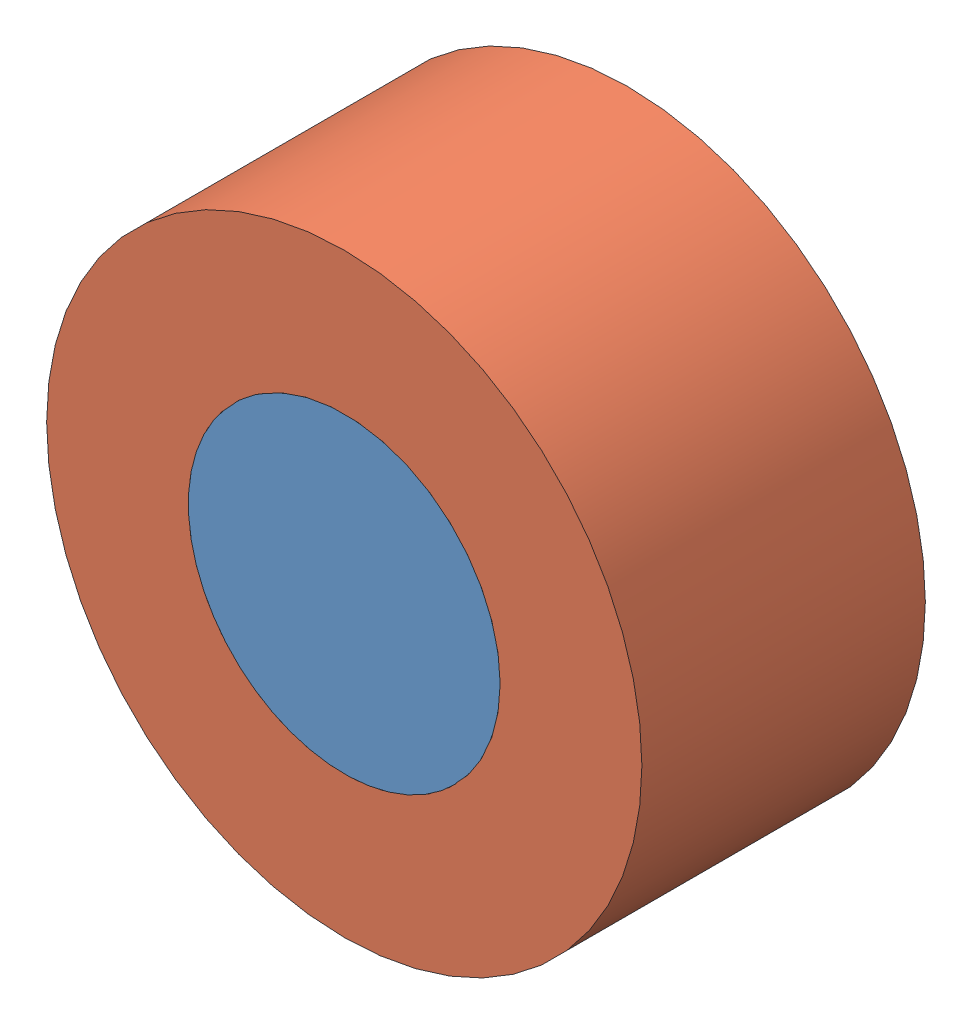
SolidWorks assembly Critical Radius Small.SLDASM, configuration Default (file format 13000). Lengths in mm.
Overall size (4.2 4.2 2).
2 component instances, 2 part files, 2 mates.
Components (placement in the parent):
- Electrical Wire Small-1: Electrical Wire Small.SLDPRT [Default] at origin size (2.2 2.2 2)
- Wire Insulation Small-1: Wire Insulation Small.SLDPRT [Default] at origin size (4.2 4.2 2)
Mates (geometry in assembly coordinates):
- Concentric1: concentric aligned: cylinder of Electrical Wire Small-1 through (0 0 -1) axis (0 0 1) radius 1.1; cylinder of Wire Insulation Small-1 through (0 0 -1) axis (0 0 1) radius 1.1
- Coincident1: coincident aligned: plane of Electrical Wire Small-1 through (0 0 1) normal (0 0 1); plane of Wire Insulation Small-1 through (0 0 1) normal (0 0 1)
